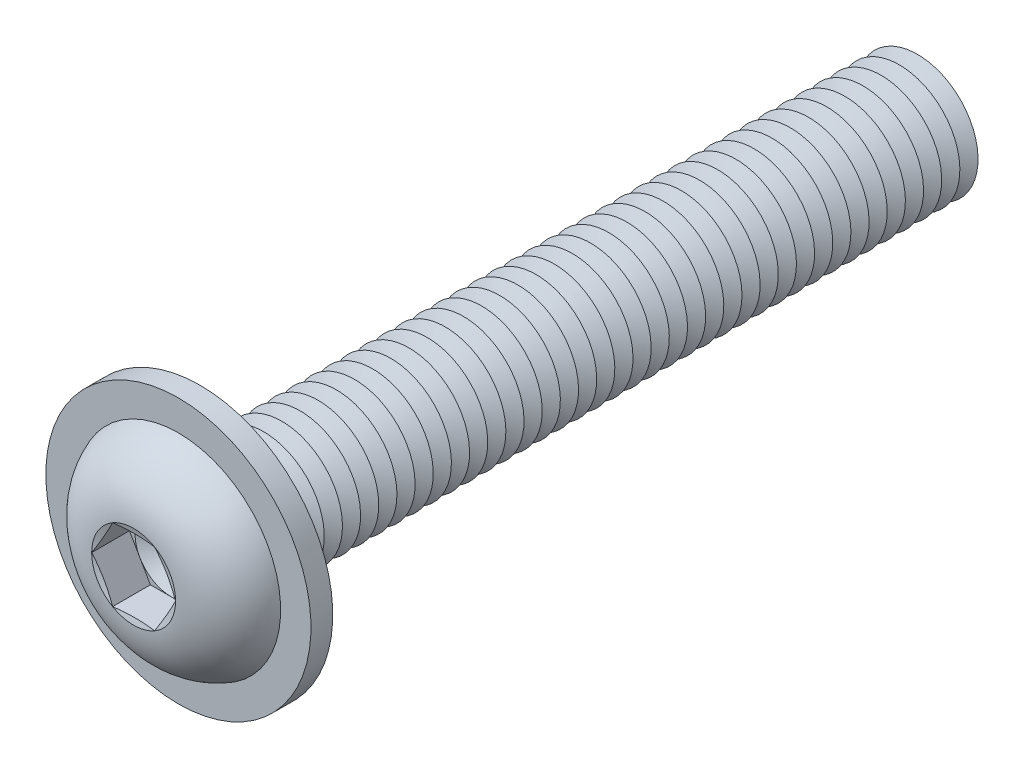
from build123d import *

# Parameters (mm, degrees)
FILLET1_R           = 0.75
LPATTERN1_COUNT     = 40
LPATTERN1_PITCH     = 1.5
CUT_EXTRUDE1_DEPTH  = 3.12
SKETCH5_R           = 10.95
SKETCH5_R_2         = 5.75
BOSS_EXTRUDE1_DEPTH = 1.8


with BuildPart() as part:
    # Sketch1 → Revolve1 (revolve)
    with BuildSketch(Plane(origin=(0, 0, 0), x_dir=(0, 0, -1), z_dir=(1, 0, 0))):
        with BuildLine():
            Line((0, 5), (0, 8.75))
            ThreePointArc((0, 8.75), (-3.814142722, 7.21429474), (-5.5, 3.4641))
            Line((-5.5, 3.4641), (-5.035898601, 1.73205))
            Line((-5.035898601, 1.73205), (-5.5, 1.73205))
            Line((-5.5, 1.73205), (-5.5, 0))
            Line((-5.5, 0), (60, 0))
            Line((60, 0), (60, 5))
            Line((60, 5), (0, 5))
        make_face()
    revolve(axis=Axis((0, 0, -60), (0, 0, 1)))

    # Fillet1
    fillet1_edges = [part.edges().sort_by_distance(p)[0] for p in [
        (0, -5, 0),
    ]]
    fillet(fillet1_edges, radius=FILLET1_R)

    # Sketch2 → Cut-Revolve1 (revolve, cut)
    with BuildSketch(Plane(origin=(0, 0, 0), x_dir=(0, 0, -1), z_dir=(1, 0, 0))):
        Polygon((59.25, 5), (60.75, 5), (60, 3.700961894), align=None)
    cut_revolve1 = revolve(axis=Axis((0, 0, -60), (0, 0, -1)), mode=Mode.SUBTRACT)

    # LPattern1: Cut-Revolve1 ×40
    with Locations(*[(0, 0, i * LPATTERN1_PITCH) for i in range(1, LPATTERN1_COUNT)]):
        add(cut_revolve1, mode=Mode.SUBTRACT)

    # Sketch3 → Cut-Extrude1 (cut)
    with BuildSketch(Plane.XY.offset(5.5)):
        Polygon((1.73205, 2.999998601), (-1.73205, 2.999998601), (-3.4641, 0), (-1.73205, -2.999998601), (1.73205, -2.999998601), (3.4641, 0), align=None)
    extrude(amount=-CUT_EXTRUDE1_DEPTH, mode=Mode.SUBTRACT)

    # Cut-Extrude2 cone 1 section (on through the dimple's axis) → Cut-Extrude2 (revolve, cut)
    with BuildSketch(Plane(origin=(0, 0, 2.38), x_dir=(0, -1, 0), z_dir=(1, 0, 0))):
        Polygon((0, 0), (2.999998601, 0), (0, 1.73205), align=None)
    revolve(axis=Axis((0, 0, 2.38), (0, 0, -1)), mode=Mode.SUBTRACT)

    # Sketch5 → Boss-Extrude1 (add)
    with BuildSketch(Plane(origin=(0, 0, 0), x_dir=(-1, 0, 0), z_dir=(0, 0, -1))):
        with Locations(Location((0, 0, 0), (0, 0, 90))):
            Circle(SKETCH5_R)
        Circle(SKETCH5_R_2, mode=Mode.SUBTRACT)
    extrude(amount=-BOSS_EXTRUDE1_DEPTH)


solid = part.part
